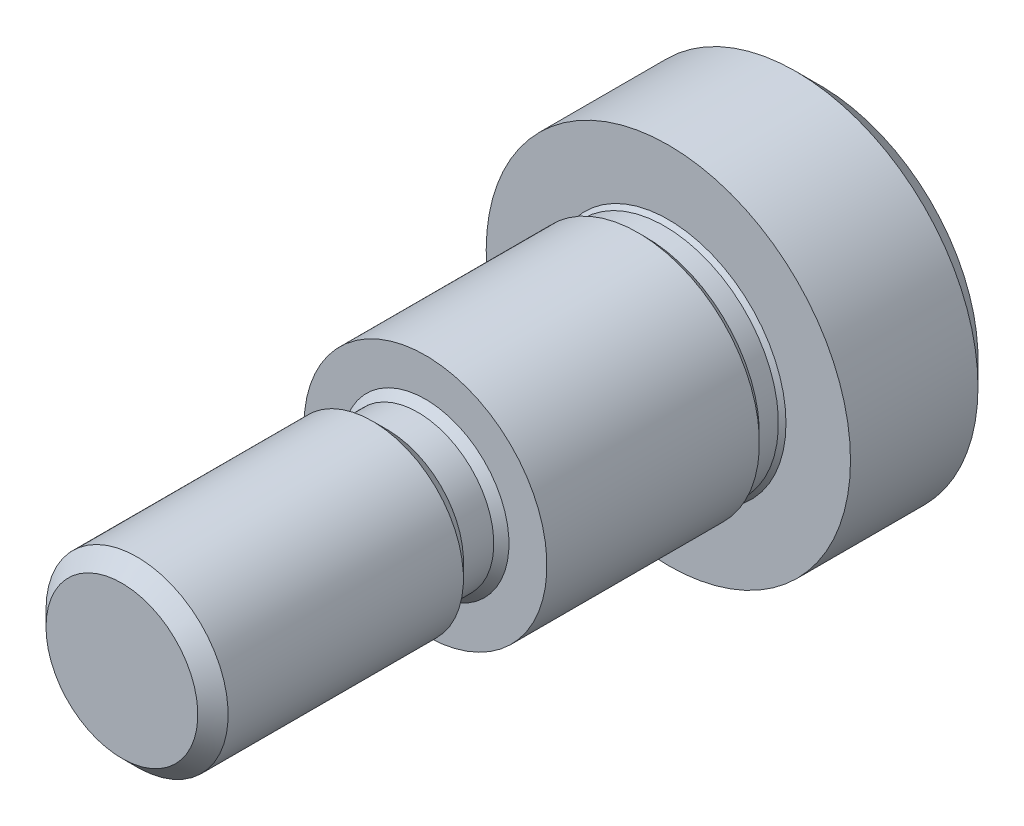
ISO-10303-21;
HEADER;
FILE_DESCRIPTION(('STEP AP214'),'2;1');
FILE_NAME('part.step','',(''),(''),'','','');
FILE_SCHEMA(('AUTOMOTIVE_DESIGN { 1 0 10303 214 1 1 1 1 }'));
ENDSEC;
DATA;
#1=APPLICATION_CONTEXT('core data for automotive mechanical design processes');
#2=APPLICATION_PROTOCOL_DEFINITION('international standard','automotive_design',2000,#1);
#3=PRODUCT_CONTEXT('',#1,'mechanical');
#4=PRODUCT('Part','Part','',(#3));
#5=PRODUCT_RELATED_PRODUCT_CATEGORY('part','',(#4));
#6=PRODUCT_DEFINITION_FORMATION('','',#4);
#7=PRODUCT_DEFINITION_CONTEXT('part definition',#1,'design');
#8=PRODUCT_DEFINITION('design','',#6,#7);
#9=PRODUCT_DEFINITION_SHAPE('','',#8);
#10=(LENGTH_UNIT() NAMED_UNIT(*) SI_UNIT(.MILLI.,.METRE.));
#11=(NAMED_UNIT(*) PLANE_ANGLE_UNIT() SI_UNIT($,.RADIAN.));
#12=(NAMED_UNIT(*) SI_UNIT($,.STERADIAN.) SOLID_ANGLE_UNIT());
#13=UNCERTAINTY_MEASURE_WITH_UNIT(LENGTH_MEASURE(1.E-05),#10,'distance_accuracy_value','');
#14=(GEOMETRIC_REPRESENTATION_CONTEXT(3) GLOBAL_UNCERTAINTY_ASSIGNED_CONTEXT((#13)) GLOBAL_UNIT_ASSIGNED_CONTEXT((#10,
#11,#12)) REPRESENTATION_CONTEXT('',''));
#15=CARTESIAN_POINT('',(0.,0.,0.));
#16=DIRECTION('',(0.,0.,1.));
#17=DIRECTION('',(1.,0.,0.));
#18=AXIS2_PLACEMENT_3D('',#15,#16,#17);
#19=CARTESIAN_POINT('',(0.,0.,-62.352722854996));
#20=DIRECTION('',(0.,0.,-1.));
#21=DIRECTION('',(-1.,0.,0.));
#22=AXIS2_PLACEMENT_3D('',#19,#20,#21);
#23=CYLINDRICAL_SURFACE('',#22,6.35);
#24=CARTESIAN_POINT('',(0.,0.,-11.1125));
#25=DIRECTION('',(0.,0.,-1.));
#26=DIRECTION('',(-1.,0.,0.));
#27=AXIS2_PLACEMENT_3D('',#24,#25,#26);
#28=CIRCLE('',#27,6.35);
#29=CARTESIAN_POINT('',(-6.35000000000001,0.,-11.1125));
#30=VERTEX_POINT('',#29);
#31=EDGE_CURVE('E164',#30,#30,#28,.T.);
#32=ORIENTED_EDGE('',*,*,#31,.F.);
#33=EDGE_LOOP('',(#32));
#34=FACE_BOUND('',#33,.T.);
#35=CARTESIAN_POINT('',(0.,0.,0.));
#36=DIRECTION('',(0.,0.,-1.));
#37=DIRECTION('',(-1.,0.,0.));
#38=AXIS2_PLACEMENT_3D('',#35,#36,#37);
#39=CIRCLE('',#38,6.35);
#40=CARTESIAN_POINT('',(-6.35000000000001,0.,0.));
#41=VERTEX_POINT('',#40);
#42=EDGE_CURVE('E11',#41,#41,#39,.T.);
#43=ORIENTED_EDGE('',*,*,#42,.T.);
#44=EDGE_LOOP('',(#43));
#45=FACE_BOUND('',#44,.T.);
#46=ADVANCED_FACE('F49',(#34,#45),#23,.T.);
#47=CARTESIAN_POINT('',(-6.35000000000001,0.,0.));
#48=DIRECTION('',(0.,0.,-1.));
#49=DIRECTION('',(-1.,0.,0.));
#50=AXIS2_PLACEMENT_3D('',#47,#48,#49);
#51=PLANE('',#50);
#52=ORIENTED_EDGE('',*,*,#42,.F.);
#53=EDGE_LOOP('',(#52));
#54=FACE_BOUND('',#53,.T.);
#55=CARTESIAN_POINT('',(0.,0.,0.));
#56=DIRECTION('',(0.,0.,-1.));
#57=DIRECTION('',(-1.,0.,0.));
#58=AXIS2_PLACEMENT_3D('',#55,#56,#57);
#59=CIRCLE('',#58,4.365625);
#60=CARTESIAN_POINT('',(-4.365625,0.,0.));
#61=VERTEX_POINT('',#60);
#62=EDGE_CURVE('E57',#61,#61,#59,.T.);
#63=ORIENTED_EDGE('',*,*,#62,.T.);
#64=EDGE_LOOP('',(#63));
#65=FACE_BOUND('',#64,.T.);
#66=ADVANCED_FACE('F225',(#54,#65),#51,.F.);
#67=CARTESIAN_POINT('',(0.,0.,0.396875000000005));
#68=DIRECTION('',(0.,0.,-1.));
#69=DIRECTION('',(-1.,0.,0.));
#70=AXIS2_PLACEMENT_3D('',#67,#68,#69);
#71=CONICAL_SURFACE('',#70,3.96875,0.78539816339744);
#72=ORIENTED_EDGE('',*,*,#62,.F.);
#73=EDGE_LOOP('',(#72));
#74=FACE_BOUND('',#73,.T.);
#75=CARTESIAN_POINT('',(0.,0.,0.396875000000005));
#76=DIRECTION('',(0.,0.,-1.));
#77=DIRECTION('',(-1.,0.,0.));
#78=AXIS2_PLACEMENT_3D('',#75,#76,#77);
#79=CIRCLE('',#78,3.96875);
#80=CARTESIAN_POINT('',(-3.96875000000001,0.,0.396875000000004));
#81=VERTEX_POINT('',#80);
#82=EDGE_CURVE('E217',#81,#81,#79,.T.);
#83=ORIENTED_EDGE('',*,*,#82,.T.);
#84=EDGE_LOOP('',(#83));
#85=FACE_BOUND('',#84,.T.);
#86=ADVANCED_FACE('F227',(#74,#85),#71,.T.);
#87=CARTESIAN_POINT('',(0.,0.,-62.352722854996));
#88=DIRECTION('',(0.,0.,-1.));
#89=DIRECTION('',(-1.,0.,0.));
#90=AXIS2_PLACEMENT_3D('',#87,#88,#89);
#91=CYLINDRICAL_SURFACE('',#90,3.96875);
#92=ORIENTED_EDGE('',*,*,#82,.F.);
#93=EDGE_LOOP('',(#92));
#94=FACE_BOUND('',#93,.T.);
#95=CARTESIAN_POINT('',(0.,0.,1.984375));
#96=DIRECTION('',(0.,0.,-1.));
#97=DIRECTION('',(-1.,0.,0.));
#98=AXIS2_PLACEMENT_3D('',#95,#96,#97);
#99=CIRCLE('',#98,3.96875);
#100=CARTESIAN_POINT('',(-3.96875000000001,0.,1.984375));
#101=VERTEX_POINT('',#100);
#102=EDGE_CURVE('E213',#101,#101,#99,.T.);
#103=ORIENTED_EDGE('',*,*,#102,.T.);
#104=EDGE_LOOP('',(#103));
#105=FACE_BOUND('',#104,.T.);
#106=ADVANCED_FACE('F230',(#94,#105),#91,.T.);
#107=CARTESIAN_POINT('',(0.,0.,2.77812500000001));
#108=DIRECTION('',(0.,0.,1.));
#109=DIRECTION('',(1.,0.,0.));
#110=AXIS2_PLACEMENT_3D('',#107,#108,#109);
#111=CONICAL_SURFACE('',#110,4.7625,0.785398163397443);
#112=ORIENTED_EDGE('',*,*,#102,.F.);
#113=EDGE_LOOP('',(#112));
#114=FACE_BOUND('',#113,.T.);
#115=CARTESIAN_POINT('',(0.,0.,2.77812500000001));
#116=DIRECTION('',(0.,0.,-1.));
#117=DIRECTION('',(-1.,0.,0.));
#118=AXIS2_PLACEMENT_3D('',#115,#116,#117);
#119=CIRCLE('',#118,4.7625);
#120=CARTESIAN_POINT('',(-4.76250000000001,0.,2.77812500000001));
#121=VERTEX_POINT('',#120);
#122=EDGE_CURVE('E209',#121,#121,#119,.T.);
#123=ORIENTED_EDGE('',*,*,#122,.T.);
#124=EDGE_LOOP('',(#123));
#125=FACE_BOUND('',#124,.T.);
#126=ADVANCED_FACE('F236',(#114,#125),#111,.T.);
#127=CARTESIAN_POINT('',(0.,0.,-62.352722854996));
#128=DIRECTION('',(0.,0.,-1.));
#129=DIRECTION('',(-1.,0.,0.));
#130=AXIS2_PLACEMENT_3D('',#127,#128,#129);
#131=CYLINDRICAL_SURFACE('',#130,4.7625);
#132=ORIENTED_EDGE('',*,*,#122,.F.);
#133=EDGE_LOOP('',(#132));
#134=FACE_BOUND('',#133,.T.);
#135=CARTESIAN_POINT('',(0.,0.,15.08125));
#136=DIRECTION('',(0.,0.,-1.));
#137=DIRECTION('',(-1.,0.,0.));
#138=AXIS2_PLACEMENT_3D('',#135,#136,#137);
#139=CIRCLE('',#138,4.7625);
#140=CARTESIAN_POINT('',(-4.76250000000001,0.,15.08125));
#141=VERTEX_POINT('',#140);
#142=EDGE_CURVE('E205',#141,#141,#139,.T.);
#143=ORIENTED_EDGE('',*,*,#142,.T.);
#144=EDGE_LOOP('',(#143));
#145=FACE_BOUND('',#144,.T.);
#146=ADVANCED_FACE('F242',(#134,#145),#131,.T.);
#147=CARTESIAN_POINT('',(0.,0.,15.875));
#148=DIRECTION('',(0.,0.,-1.));
#149=DIRECTION('',(-1.,0.,0.));
#150=AXIS2_PLACEMENT_3D('',#147,#148,#149);
#151=CONICAL_SURFACE('',#150,3.96875,0.785398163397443);
#152=ORIENTED_EDGE('',*,*,#142,.F.);
#153=EDGE_LOOP('',(#152));
#154=FACE_BOUND('',#153,.T.);
#155=CARTESIAN_POINT('',(0.,0.,15.875));
#156=DIRECTION('',(0.,0.,-1.));
#157=DIRECTION('',(-1.,0.,0.));
#158=AXIS2_PLACEMENT_3D('',#155,#156,#157);
#159=CIRCLE('',#158,3.96875);
#160=CARTESIAN_POINT('',(-3.96875000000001,0.,15.875));
#161=VERTEX_POINT('',#160);
#162=EDGE_CURVE('E201',#161,#161,#159,.T.);
#163=ORIENTED_EDGE('',*,*,#162,.T.);
#164=EDGE_LOOP('',(#163));
#165=FACE_BOUND('',#164,.T.);
#166=ADVANCED_FACE('F248',(#154,#165),#151,.T.);
#167=CARTESIAN_POINT('',(-3.96875000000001,0.,15.875));
#168=DIRECTION('',(0.,0.,-1.));
#169=DIRECTION('',(-1.,0.,0.));
#170=AXIS2_PLACEMENT_3D('',#167,#168,#169);
#171=PLANE('',#170);
#172=ORIENTED_EDGE('',*,*,#162,.F.);
#173=EDGE_LOOP('',(#172));
#174=FACE_BOUND('',#173,.T.);
#175=ADVANCED_FACE('F254',(#174),#171,.F.);
#176=CARTESIAN_POINT('',(-8.255,0.,-20.6375));
#177=DIRECTION('',(0.,0.,1.));
#178=DIRECTION('',(1.,0.,0.));
#179=AXIS2_PLACEMENT_3D('',#176,#177,#178);
#180=PLANE('',#179);
#181=DIRECTION('',(-0.5,-0.866025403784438,0.));
#182=VECTOR('',#181,1.);
#183=CARTESIAN_POINT('',(3.66617420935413,0.,-20.6375));
#184=LINE('',#183,#182);
#185=CARTESIAN_POINT('',(3.66617420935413,0.,-20.6375));
#186=VERTEX_POINT('',#185);
#187=CARTESIAN_POINT('',(1.83308710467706,-3.175,-20.6375));
#188=VERTEX_POINT('',#187);
#189=EDGE_CURVE('E145',#186,#188,#184,.T.);
#190=ORIENTED_EDGE('',*,*,#189,.F.);
#191=DIRECTION('',(0.499999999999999,-0.866025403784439,0.));
#192=VECTOR('',#191,1.);
#193=CARTESIAN_POINT('',(1.83308710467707,3.175,-20.6375));
#194=LINE('',#193,#192);
#195=CARTESIAN_POINT('',(1.83308710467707,3.175,-20.6375));
#196=VERTEX_POINT('',#195);
#197=EDGE_CURVE('E64',#196,#186,#194,.T.);
#198=ORIENTED_EDGE('',*,*,#197,.F.);
#199=DIRECTION('',(1.,0.,0.));
#200=VECTOR('',#199,1.);
#201=CARTESIAN_POINT('',(-1.83308710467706,3.175,-20.6375));
#202=LINE('',#201,#200);
#203=CARTESIAN_POINT('',(-1.83308710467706,3.175,-20.6375));
#204=VERTEX_POINT('',#203);
#205=EDGE_CURVE('E158',#204,#196,#202,.T.);
#206=ORIENTED_EDGE('',*,*,#205,.F.);
#207=DIRECTION('',(0.5,0.866025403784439,0.));
#208=VECTOR('',#207,1.);
#209=CARTESIAN_POINT('',(-3.66617420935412,0.,-20.6375));
#210=LINE('',#209,#208);
#211=CARTESIAN_POINT('',(-3.66617420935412,0.,-20.6375));
#212=VERTEX_POINT('',#211);
#213=EDGE_CURVE('E155',#212,#204,#210,.T.);
#214=ORIENTED_EDGE('',*,*,#213,.F.);
#215=DIRECTION('',(-0.499999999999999,0.866025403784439,0.));
#216=VECTOR('',#215,1.);
#217=CARTESIAN_POINT('',(-1.83308710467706,-3.175,-20.6375));
#218=LINE('',#217,#216);
#219=CARTESIAN_POINT('',(-1.83308710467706,-3.175,-20.6375));
#220=VERTEX_POINT('',#219);
#221=EDGE_CURVE('E112',#220,#212,#218,.T.);
#222=ORIENTED_EDGE('',*,*,#221,.F.);
#223=DIRECTION('',(-1.,0.,0.));
#224=VECTOR('',#223,1.);
#225=CARTESIAN_POINT('',(1.83308710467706,-3.175,-20.6375));
#226=LINE('',#225,#224);
#227=EDGE_CURVE('E149',#188,#220,#226,.T.);
#228=ORIENTED_EDGE('',*,*,#227,.F.);
#229=EDGE_LOOP('',(#190,#198,#206,#214,#222,#228));
#230=FACE_BOUND('',#229,.T.);
#231=CARTESIAN_POINT('',(0.,0.,-20.6375));
#232=DIRECTION('',(0.,0.,-1.));
#233=DIRECTION('',(-1.,0.,0.));
#234=AXIS2_PLACEMENT_3D('',#231,#232,#233);
#235=CIRCLE('',#234,8.255);
#236=CARTESIAN_POINT('',(-8.255,0.,-20.6375));
#237=VERTEX_POINT('',#236);
#238=EDGE_CURVE('E197',#237,#237,#235,.T.);
#239=ORIENTED_EDGE('',*,*,#238,.T.);
#240=EDGE_LOOP('',(#239));
#241=FACE_BOUND('',#240,.T.);
#242=ADVANCED_FACE('F259',(#230,#241),#180,.F.);
#243=CARTESIAN_POINT('',(0.,0.,-19.3675));
#244=DIRECTION('',(0.,0.,1.));
#245=DIRECTION('',(1.,0.,0.));
#246=AXIS2_PLACEMENT_3D('',#243,#244,#245);
#247=CONICAL_SURFACE('',#246,9.525,0.785398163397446);
#248=ORIENTED_EDGE('',*,*,#238,.F.);
#249=EDGE_LOOP('',(#248));
#250=FACE_BOUND('',#249,.T.);
#251=CARTESIAN_POINT('',(0.,0.,-19.3675));
#252=DIRECTION('',(0.,0.,-1.));
#253=DIRECTION('',(-1.,0.,0.));
#254=AXIS2_PLACEMENT_3D('',#251,#252,#253);
#255=CIRCLE('',#254,9.525);
#256=CARTESIAN_POINT('',(-9.525,0.,-19.3675));
#257=VERTEX_POINT('',#256);
#258=EDGE_CURVE('E193',#257,#257,#255,.T.);
#259=ORIENTED_EDGE('',*,*,#258,.T.);
#260=EDGE_LOOP('',(#259));
#261=FACE_BOUND('',#260,.T.);
#262=ADVANCED_FACE('F266',(#250,#261),#247,.T.);
#263=CARTESIAN_POINT('',(0.,0.,-62.352722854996));
#264=DIRECTION('',(0.,0.,-1.));
#265=DIRECTION('',(-1.,0.,0.));
#266=AXIS2_PLACEMENT_3D('',#263,#264,#265);
#267=CYLINDRICAL_SURFACE('',#266,9.525);
#268=ORIENTED_EDGE('',*,*,#258,.F.);
#269=EDGE_LOOP('',(#268));
#270=FACE_BOUND('',#269,.T.);
#271=CARTESIAN_POINT('',(0.,0.,-12.7));
#272=DIRECTION('',(0.,0.,-1.));
#273=DIRECTION('',(-1.,0.,0.));
#274=AXIS2_PLACEMENT_3D('',#271,#272,#273);
#275=CIRCLE('',#274,9.525);
#276=CARTESIAN_POINT('',(-9.525,0.,-12.7));
#277=VERTEX_POINT('',#276);
#278=EDGE_CURVE('E189',#277,#277,#275,.T.);
#279=ORIENTED_EDGE('',*,*,#278,.T.);
#280=EDGE_LOOP('',(#279));
#281=FACE_BOUND('',#280,.T.);
#282=ADVANCED_FACE('F303',(#270,#281),#267,.T.);
#283=CARTESIAN_POINT('',(-6.15156250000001,0.,-12.7));
#284=DIRECTION('',(0.,0.,-1.));
#285=DIRECTION('',(-1.,0.,0.));
#286=AXIS2_PLACEMENT_3D('',#283,#284,#285);
#287=PLANE('',#286);
#288=ORIENTED_EDGE('',*,*,#278,.F.);
#289=EDGE_LOOP('',(#288));
#290=FACE_BOUND('',#289,.T.);
#291=CARTESIAN_POINT('',(0.,0.,-12.7));
#292=DIRECTION('',(0.,0.,-1.));
#293=DIRECTION('',(-1.,0.,0.));
#294=AXIS2_PLACEMENT_3D('',#291,#292,#293);
#295=CIRCLE('',#294,6.15156250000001);
#296=CARTESIAN_POINT('',(-6.15156250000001,0.,-12.7));
#297=VERTEX_POINT('',#296);
#298=EDGE_CURVE('E185',#297,#297,#295,.T.);
#299=ORIENTED_EDGE('',*,*,#298,.T.);
#300=EDGE_LOOP('',(#299));
#301=FACE_BOUND('',#300,.T.);
#302=ADVANCED_FACE('F299',(#290,#301),#287,.F.);
#303=CARTESIAN_POINT('',(0.,0.,-12.5015625));
#304=DIRECTION('',(0.,0.,-1.));
#305=DIRECTION('',(-1.,0.,0.));
#306=AXIS2_PLACEMENT_3D('',#303,#304,#305);
#307=CONICAL_SURFACE('',#306,5.953125,0.78539816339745);
#308=ORIENTED_EDGE('',*,*,#298,.F.);
#309=EDGE_LOOP('',(#308));
#310=FACE_BOUND('',#309,.T.);
#311=CARTESIAN_POINT('',(0.,0.,-12.5015625));
#312=DIRECTION('',(0.,0.,-1.));
#313=DIRECTION('',(-1.,0.,0.));
#314=AXIS2_PLACEMENT_3D('',#311,#312,#313);
#315=CIRCLE('',#314,5.953125);
#316=CARTESIAN_POINT('',(-5.95312500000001,0.,-12.5015625));
#317=VERTEX_POINT('',#316);
#318=EDGE_CURVE('E181',#317,#317,#315,.T.);
#319=ORIENTED_EDGE('',*,*,#318,.T.);
#320=EDGE_LOOP('',(#319));
#321=FACE_BOUND('',#320,.T.);
#322=ADVANCED_FACE('F291',(#310,#321),#307,.T.);
#323=CARTESIAN_POINT('',(0.,0.,-62.352722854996));
#324=DIRECTION('',(0.,0.,-1.));
#325=DIRECTION('',(-1.,0.,0.));
#326=AXIS2_PLACEMENT_3D('',#323,#324,#325);
#327=CYLINDRICAL_SURFACE('',#326,5.953125);
#328=ORIENTED_EDGE('',*,*,#318,.F.);
#329=EDGE_LOOP('',(#328));
#330=FACE_BOUND('',#329,.T.);
#331=CARTESIAN_POINT('',(0.,0.,-11.509375));
#332=DIRECTION('',(0.,0.,-1.));
#333=DIRECTION('',(-1.,0.,0.));
#334=AXIS2_PLACEMENT_3D('',#331,#332,#333);
#335=CIRCLE('',#334,5.953125);
#336=CARTESIAN_POINT('',(-5.95312500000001,0.,-11.509375));
#337=VERTEX_POINT('',#336);
#338=EDGE_CURVE('E177',#337,#337,#335,.T.);
#339=ORIENTED_EDGE('',*,*,#338,.T.);
#340=EDGE_LOOP('',(#339));
#341=FACE_BOUND('',#340,.T.);
#342=ADVANCED_FACE('F282',(#330,#341),#327,.T.);
#343=CARTESIAN_POINT('',(0.,0.,-11.1125));
#344=DIRECTION('',(0.,0.,1.));
#345=DIRECTION('',(1.,0.,0.));
#346=AXIS2_PLACEMENT_3D('',#343,#344,#345);
#347=CONICAL_SURFACE('',#346,6.35,0.785398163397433);
#348=ORIENTED_EDGE('',*,*,#338,.F.);
#349=EDGE_LOOP('',(#348));
#350=FACE_BOUND('',#349,.T.);
#351=ORIENTED_EDGE('',*,*,#31,.T.);
#352=EDGE_LOOP('',(#351));
#353=FACE_BOUND('',#352,.T.);
#354=ADVANCED_FACE('F279',(#350,#353),#347,.T.);
#355=CARTESIAN_POINT('',(1.83308710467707,3.175,-15.3458333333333));
#356=DIRECTION('',(0.866025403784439,0.499999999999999,0.));
#357=DIRECTION('',(-0.499999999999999,0.866025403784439,0.));
#358=AXIS2_PLACEMENT_3D('',#355,#356,#357);
#359=PLANE('',#358);
#360=ORIENTED_EDGE('',*,*,#197,.T.);
#361=DIRECTION('',(0.,0.,-1.));
#362=VECTOR('',#361,1.);
#363=CARTESIAN_POINT('',(3.66617420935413,0.,-15.3458333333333));
#364=LINE('',#363,#362);
#365=CARTESIAN_POINT('',(3.66617420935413,0.,-15.3458333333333));
#366=VERTEX_POINT('',#365);
#367=EDGE_CURVE('E94',#366,#186,#364,.T.);
#368=ORIENTED_EDGE('',*,*,#367,.F.);
#369=DIRECTION('',(0.499999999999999,-0.866025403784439,0.));
#370=VECTOR('',#369,1.);
#371=CARTESIAN_POINT('',(1.83308710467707,3.175,-15.3458333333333));
#372=LINE('',#371,#370);
#373=CARTESIAN_POINT('',(1.83308710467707,3.175,-15.3458333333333));
#374=VERTEX_POINT('',#373);
#375=EDGE_CURVE('E161',#374,#366,#372,.T.);
#376=ORIENTED_EDGE('',*,*,#375,.F.);
#377=DIRECTION('',(0.,0.,-1.));
#378=VECTOR('',#377,1.);
#379=CARTESIAN_POINT('',(1.83308710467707,3.175,-15.3458333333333));
#380=LINE('',#379,#378);
#381=EDGE_CURVE('E72',#374,#196,#380,.T.);
#382=ORIENTED_EDGE('',*,*,#381,.T.);
#383=EDGE_LOOP('',(#360,#368,#376,#382));
#384=FACE_BOUND('',#383,.T.);
#385=ADVANCED_FACE('F281',(#384),#359,.F.);
#386=CARTESIAN_POINT('',(-1.83308710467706,3.175,-15.3458333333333));
#387=DIRECTION('',(0.,1.,0.));
#388=DIRECTION('',(-1.,0.,0.));
#389=AXIS2_PLACEMENT_3D('',#386,#387,#388);
#390=PLANE('',#389);
#391=ORIENTED_EDGE('',*,*,#205,.T.);
#392=ORIENTED_EDGE('',*,*,#381,.F.);
#393=DIRECTION('',(1.,0.,0.));
#394=VECTOR('',#393,1.);
#395=CARTESIAN_POINT('',(-1.83308710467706,3.175,-15.3458333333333));
#396=LINE('',#395,#394);
#397=CARTESIAN_POINT('',(-1.83308710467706,3.175,-15.3458333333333));
#398=VERTEX_POINT('',#397);
#399=EDGE_CURVE('E126',#398,#374,#396,.T.);
#400=ORIENTED_EDGE('',*,*,#399,.F.);
#401=DIRECTION('',(0.,0.,-1.));
#402=VECTOR('',#401,1.);
#403=CARTESIAN_POINT('',(-1.83308710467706,3.175,-15.3458333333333));
#404=LINE('',#403,#402);
#405=EDGE_CURVE('E117',#398,#204,#404,.T.);
#406=ORIENTED_EDGE('',*,*,#405,.T.);
#407=EDGE_LOOP('',(#391,#392,#400,#406));
#408=FACE_BOUND('',#407,.T.);
#409=ADVANCED_FACE('F289',(#408),#390,.F.);
#410=CARTESIAN_POINT('',(-3.66617420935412,0.,-15.3458333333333));
#411=DIRECTION('',(-0.866025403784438,0.5,0.));
#412=DIRECTION('',(-0.5,-0.866025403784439,0.));
#413=AXIS2_PLACEMENT_3D('',#410,#411,#412);
#414=PLANE('',#413);
#415=ORIENTED_EDGE('',*,*,#213,.T.);
#416=ORIENTED_EDGE('',*,*,#405,.F.);
#417=DIRECTION('',(0.5,0.866025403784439,0.));
#418=VECTOR('',#417,1.);
#419=CARTESIAN_POINT('',(-3.66617420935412,0.,-15.3458333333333));
#420=LINE('',#419,#418);
#421=CARTESIAN_POINT('',(-3.66617420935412,0.,-15.3458333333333));
#422=VERTEX_POINT('',#421);
#423=EDGE_CURVE('E121',#422,#398,#420,.T.);
#424=ORIENTED_EDGE('',*,*,#423,.F.);
#425=DIRECTION('',(0.,0.,-1.));
#426=VECTOR('',#425,1.);
#427=CARTESIAN_POINT('',(-3.66617420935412,0.,-15.3458333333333));
#428=LINE('',#427,#426);
#429=EDGE_CURVE('E105',#422,#212,#428,.T.);
#430=ORIENTED_EDGE('',*,*,#429,.T.);
#431=EDGE_LOOP('',(#415,#416,#424,#430));
#432=FACE_BOUND('',#431,.T.);
#433=ADVANCED_FACE('F122',(#432),#414,.F.);
#434=CARTESIAN_POINT('',(-1.83308710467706,-3.175,-15.3458333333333));
#435=DIRECTION('',(-0.866025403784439,-0.499999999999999,0.));
#436=DIRECTION('',(0.5,-0.866025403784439,0.));
#437=AXIS2_PLACEMENT_3D('',#434,#435,#436);
#438=PLANE('',#437);
#439=ORIENTED_EDGE('',*,*,#221,.T.);
#440=ORIENTED_EDGE('',*,*,#429,.F.);
#441=DIRECTION('',(-0.499999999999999,0.866025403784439,0.));
#442=VECTOR('',#441,1.);
#443=CARTESIAN_POINT('',(-1.83308710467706,-3.175,-15.3458333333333));
#444=LINE('',#443,#442);
#445=CARTESIAN_POINT('',(-1.83308710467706,-3.175,-15.3458333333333));
#446=VERTEX_POINT('',#445);
#447=EDGE_CURVE('E109',#446,#422,#444,.T.);
#448=ORIENTED_EDGE('',*,*,#447,.F.);
#449=DIRECTION('',(0.,0.,-1.));
#450=VECTOR('',#449,1.);
#451=CARTESIAN_POINT('',(-1.83308710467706,-3.175,-15.3458333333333));
#452=LINE('',#451,#450);
#453=EDGE_CURVE('E118',#446,#220,#452,.T.);
#454=ORIENTED_EDGE('',*,*,#453,.T.);
#455=EDGE_LOOP('',(#439,#440,#448,#454));
#456=FACE_BOUND('',#455,.T.);
#457=ADVANCED_FACE('F107',(#456),#438,.F.);
#458=CARTESIAN_POINT('',(1.83308710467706,-3.175,-15.3458333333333));
#459=DIRECTION('',(0.,-1.,0.));
#460=DIRECTION('',(1.,0.,0.));
#461=AXIS2_PLACEMENT_3D('',#458,#459,#460);
#462=PLANE('',#461);
#463=ORIENTED_EDGE('',*,*,#227,.T.);
#464=ORIENTED_EDGE('',*,*,#453,.F.);
#465=DIRECTION('',(-1.,0.,0.));
#466=VECTOR('',#465,1.);
#467=CARTESIAN_POINT('',(1.83308710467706,-3.175,-15.3458333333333));
#468=LINE('',#467,#466);
#469=CARTESIAN_POINT('',(1.83308710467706,-3.175,-15.3458333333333));
#470=VERTEX_POINT('',#469);
#471=EDGE_CURVE('E132',#470,#446,#468,.T.);
#472=ORIENTED_EDGE('',*,*,#471,.F.);
#473=DIRECTION('',(0.,0.,-1.));
#474=VECTOR('',#473,1.);
#475=CARTESIAN_POINT('',(1.83308710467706,-3.175,-15.3458333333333));
#476=LINE('',#475,#474);
#477=EDGE_CURVE('E169',#470,#188,#476,.T.);
#478=ORIENTED_EDGE('',*,*,#477,.T.);
#479=EDGE_LOOP('',(#463,#464,#472,#478));
#480=FACE_BOUND('',#479,.T.);
#481=ADVANCED_FACE('F386',(#480),#462,.F.);
#482=CARTESIAN_POINT('',(3.66617420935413,0.,-15.3458333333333));
#483=DIRECTION('',(0.866025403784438,-0.5,0.));
#484=DIRECTION('',(0.5,0.866025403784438,0.));
#485=AXIS2_PLACEMENT_3D('',#482,#483,#484);
#486=PLANE('',#485);
#487=ORIENTED_EDGE('',*,*,#189,.T.);
#488=ORIENTED_EDGE('',*,*,#477,.F.);
#489=DIRECTION('',(-0.5,-0.866025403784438,0.));
#490=VECTOR('',#489,1.);
#491=CARTESIAN_POINT('',(3.66617420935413,0.,-15.3458333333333));
#492=LINE('',#491,#490);
#493=EDGE_CURVE('E137',#366,#470,#492,.T.);
#494=ORIENTED_EDGE('',*,*,#493,.F.);
#495=ORIENTED_EDGE('',*,*,#367,.T.);
#496=EDGE_LOOP('',(#487,#488,#494,#495));
#497=FACE_BOUND('',#496,.T.);
#498=ADVANCED_FACE('F397',(#497),#486,.F.);
#499=CARTESIAN_POINT('',(1.83308710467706,3.175,-15.3458333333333));
#500=DIRECTION('',(0.,0.,1.));
#501=DIRECTION('',(1.,0.,0.));
#502=AXIS2_PLACEMENT_3D('',#499,#500,#501);
#503=PLANE('',#502);
#504=ORIENTED_EDGE('',*,*,#375,.T.);
#505=ORIENTED_EDGE('',*,*,#493,.T.);
#506=ORIENTED_EDGE('',*,*,#471,.T.);
#507=ORIENTED_EDGE('',*,*,#447,.T.);
#508=ORIENTED_EDGE('',*,*,#423,.T.);
#509=ORIENTED_EDGE('',*,*,#399,.T.);
#510=EDGE_LOOP('',(#504,#505,#506,#507,#508,#509));
#511=FACE_BOUND('',#510,.T.);
#512=ADVANCED_FACE('F129',(#511),#503,.F.);
#513=CLOSED_SHELL('',(#46,#66,#86,#106,#126,#146,#166,#175,#242,#262,#282,#302,#322,#342,#354,
#385,#409,#433,#457,#481,#498,#512));
#514=MANIFOLD_SOLID_BREP('B2',#513);
#515=ADVANCED_BREP_SHAPE_REPRESENTATION('',(#18,#514),#14);
#516=SHAPE_DEFINITION_REPRESENTATION(#9,#515);
ENDSEC;
END-ISO-10303-21;
